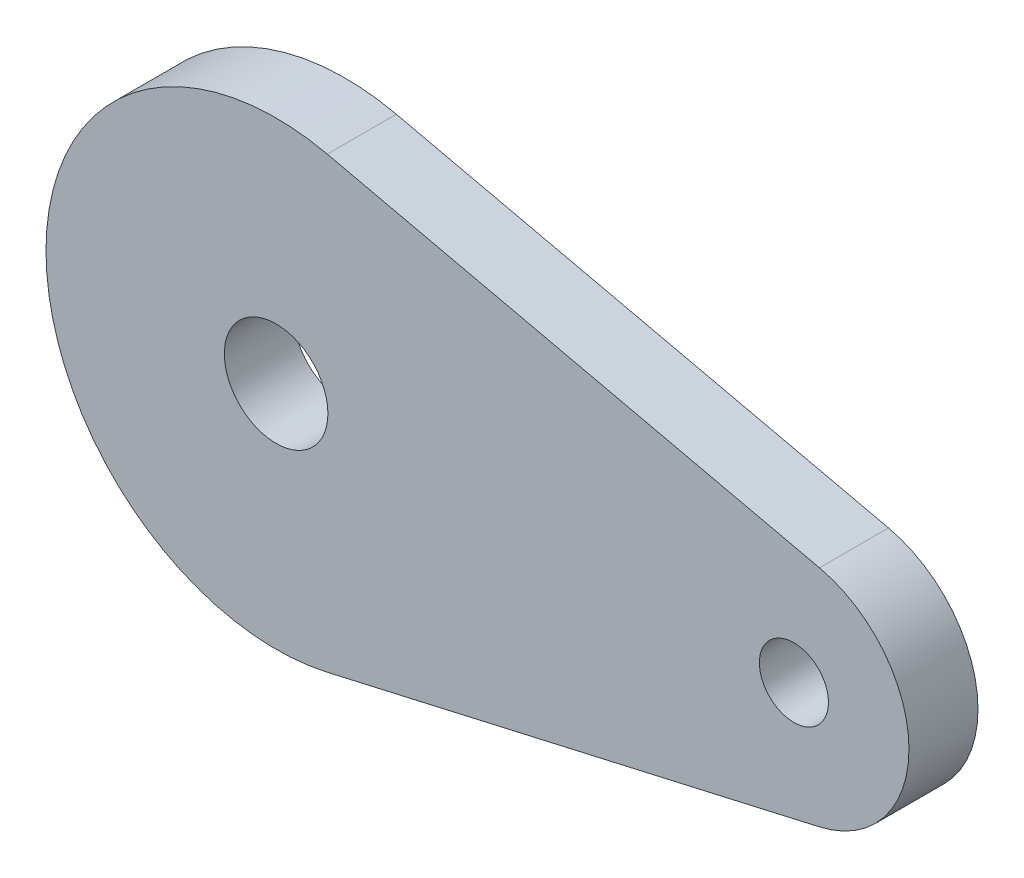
from build123d import *

# Parameters (mm, degrees)
SKETCH_1_R      = 9
SKETCH_1_R_2    = 6
EXTRUDE_1_DEPTH = 12


with BuildPart() as part:
    # Sketch 1 → Extrude 1 (new body)
    with BuildSketch(Plane.XY):
        with BuildLine():
            Line((8.888888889, 38.999841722), (94.444444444, 19.499920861))
            ThreePointArc((94.444444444, 19.499920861), (110, 0), (94.444444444, -19.499920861))
            Line((94.444444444, -19.499920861), (8.888888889, -38.999841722))
            ThreePointArc((8.888888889, -38.999841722), (-40, 0), (8.888888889, 38.999841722))
        make_face()
        Circle(SKETCH_1_R, mode=Mode.SUBTRACT)
        with Locations((90, 0)):
            Circle(SKETCH_1_R_2, mode=Mode.SUBTRACT)
    extrude(amount=EXTRUDE_1_DEPTH)


solid = part.part
